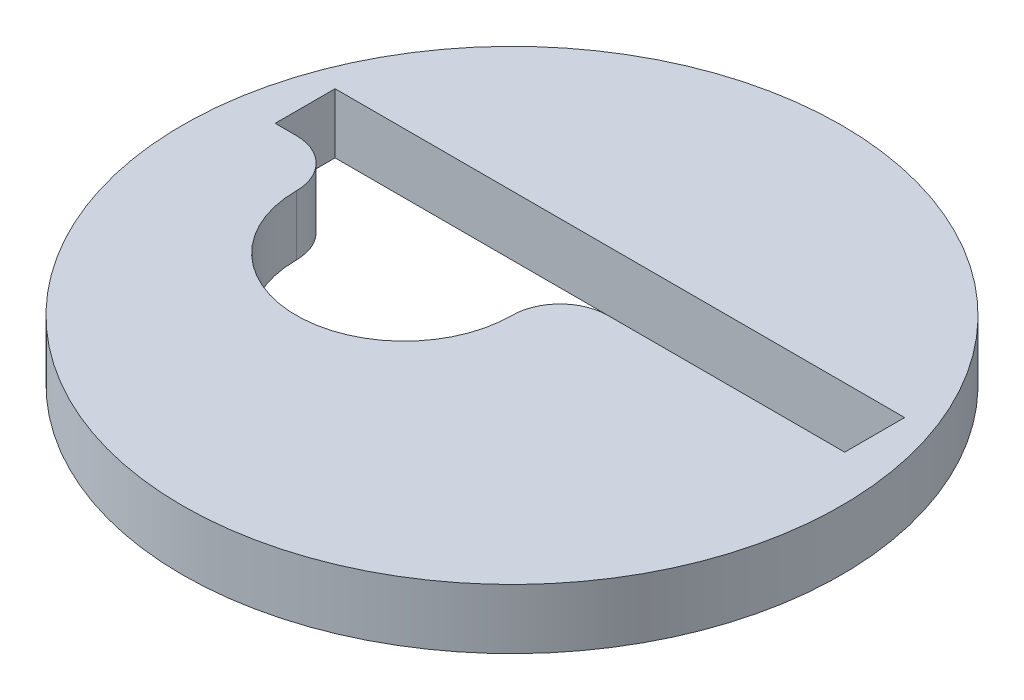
ISO-10303-21;
HEADER;
FILE_DESCRIPTION(('STEP AP214'),'2;1');
FILE_NAME('part.step','',(''),(''),'','','');
FILE_SCHEMA(('AUTOMOTIVE_DESIGN { 1 0 10303 214 1 1 1 1 }'));
ENDSEC;
DATA;
#1=APPLICATION_CONTEXT('core data for automotive mechanical design processes');
#2=APPLICATION_PROTOCOL_DEFINITION('international standard','automotive_design',2000,#1);
#3=PRODUCT_CONTEXT('',#1,'mechanical');
#4=PRODUCT('Part','Part','',(#3));
#5=PRODUCT_RELATED_PRODUCT_CATEGORY('part','',(#4));
#6=PRODUCT_DEFINITION_FORMATION('','',#4);
#7=PRODUCT_DEFINITION_CONTEXT('part definition',#1,'design');
#8=PRODUCT_DEFINITION('design','',#6,#7);
#9=PRODUCT_DEFINITION_SHAPE('','',#8);
#10=(LENGTH_UNIT() NAMED_UNIT(*) SI_UNIT(.MILLI.,.METRE.));
#11=(NAMED_UNIT(*) PLANE_ANGLE_UNIT() SI_UNIT($,.RADIAN.));
#12=(NAMED_UNIT(*) SI_UNIT($,.STERADIAN.) SOLID_ANGLE_UNIT());
#13=UNCERTAINTY_MEASURE_WITH_UNIT(LENGTH_MEASURE(1.E-05),#10,'distance_accuracy_value','');
#14=(GEOMETRIC_REPRESENTATION_CONTEXT(3) GLOBAL_UNCERTAINTY_ASSIGNED_CONTEXT((#13)) GLOBAL_UNIT_ASSIGNED_CONTEXT((#10,
#11,#12)) REPRESENTATION_CONTEXT('',''));
#15=CARTESIAN_POINT('',(0.,0.,0.));
#16=DIRECTION('',(0.,0.,1.));
#17=DIRECTION('',(1.,0.,0.));
#18=AXIS2_PLACEMENT_3D('',#15,#16,#17);
#19=CARTESIAN_POINT('',(-15.0899035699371,0.,-2.54));
#20=DIRECTION('',(0.,0.,1.));
#21=DIRECTION('',(1.,0.,0.));
#22=AXIS2_PLACEMENT_3D('',#19,#20,#21);
#23=PLANE('',#22);
#24=DIRECTION('',(1.,0.,0.));
#25=VECTOR('',#24,1.);
#26=CARTESIAN_POINT('',(-15.0899035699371,0.,-2.54));
#27=LINE('',#26,#25);
#28=CARTESIAN_POINT('',(2.54,0.,-2.54));
#29=VERTEX_POINT('',#28);
#30=CARTESIAN_POINT('',(15.0899035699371,0.,-2.54));
#31=VERTEX_POINT('',#30);
#32=EDGE_CURVE('E132',#29,#31,#27,.T.);
#33=ORIENTED_EDGE('',*,*,#32,.F.);
#34=DIRECTION('',(0.,1.,0.));
#35=VECTOR('',#34,1.);
#36=CARTESIAN_POINT('',(2.54,0.,-2.54));
#37=LINE('',#36,#35);
#38=CARTESIAN_POINT('',(2.54,3.175,-2.54));
#39=VERTEX_POINT('',#38);
#40=EDGE_CURVE('E162',#29,#39,#37,.T.);
#41=ORIENTED_EDGE('',*,*,#40,.T.);
#42=DIRECTION('',(1.,0.,0.));
#43=VECTOR('',#42,1.);
#44=CARTESIAN_POINT('',(-15.0899035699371,3.175,-2.54));
#45=LINE('',#44,#43);
#46=CARTESIAN_POINT('',(15.0899035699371,3.175,-2.54));
#47=VERTEX_POINT('',#46);
#48=EDGE_CURVE('E137',#39,#47,#45,.T.);
#49=ORIENTED_EDGE('',*,*,#48,.T.);
#50=DIRECTION('',(0.,1.,0.));
#51=VECTOR('',#50,1.);
#52=CARTESIAN_POINT('',(15.0899035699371,0.,-2.54));
#53=LINE('',#52,#51);
#54=EDGE_CURVE('E153',#31,#47,#53,.T.);
#55=ORIENTED_EDGE('',*,*,#54,.F.);
#56=EDGE_LOOP('',(#33,#41,#49,#55));
#57=FACE_BOUND('',#56,.T.);
#58=ADVANCED_FACE('F40',(#57),#23,.F.);
#59=CARTESIAN_POINT('',(0.,3.175,0.));
#60=DIRECTION('',(0.,-1.,0.));
#61=DIRECTION('',(0.,0.,-1.));
#62=AXIS2_PLACEMENT_3D('',#59,#60,#61);
#63=CYLINDRICAL_SURFACE('',#62,17.4625);
#64=CARTESIAN_POINT('',(0.,3.175,0.));
#65=DIRECTION('',(0.,1.,0.));
#66=DIRECTION('',(0.,0.,1.));
#67=AXIS2_PLACEMENT_3D('',#64,#65,#66);
#68=CIRCLE('',#67,17.4625);
#69=CARTESIAN_POINT('',(0.,3.175,17.4625));
#70=VERTEX_POINT('',#69);
#71=EDGE_CURVE('E159',#70,#70,#68,.T.);
#72=ORIENTED_EDGE('',*,*,#71,.F.);
#73=EDGE_LOOP('',(#72));
#74=FACE_BOUND('',#73,.T.);
#75=CARTESIAN_POINT('',(0.,0.,0.));
#76=DIRECTION('',(0.,1.,0.));
#77=DIRECTION('',(0.,0.,1.));
#78=AXIS2_PLACEMENT_3D('',#75,#76,#77);
#79=CIRCLE('',#78,17.4625);
#80=CARTESIAN_POINT('',(0.,0.,17.4625));
#81=VERTEX_POINT('',#80);
#82=EDGE_CURVE('E155',#81,#81,#79,.T.);
#83=ORIENTED_EDGE('',*,*,#82,.T.);
#84=EDGE_LOOP('',(#83));
#85=FACE_BOUND('',#84,.T.);
#86=ADVANCED_FACE('F202',(#74,#85),#63,.T.);
#87=CARTESIAN_POINT('',(0.,3.175,0.));
#88=DIRECTION('',(0.,1.,0.));
#89=DIRECTION('',(0.,0.,1.));
#90=AXIS2_PLACEMENT_3D('',#87,#88,#89);
#91=PLANE('',#90);
#92=ORIENTED_EDGE('',*,*,#48,.F.);
#93=CARTESIAN_POINT('',(2.54,3.175,0.));
#94=DIRECTION('',(0.,1.,0.));
#95=DIRECTION('',(0.,0.,1.));
#96=AXIS2_PLACEMENT_3D('',#93,#94,#95);
#97=CIRCLE('',#96,2.54);
#98=CARTESIAN_POINT('',(0.,3.175,0.));
#99=VERTEX_POINT('',#98);
#100=EDGE_CURVE('E169',#39,#99,#97,.T.);
#101=ORIENTED_EDGE('',*,*,#100,.T.);
#102=CARTESIAN_POINT('',(-5.715,3.175,0.));
#103=DIRECTION('',(0.,1.,0.));
#104=DIRECTION('',(0.,0.,1.));
#105=AXIS2_PLACEMENT_3D('',#102,#103,#104);
#106=CIRCLE('',#105,5.715);
#107=CARTESIAN_POINT('',(-11.43,3.175,0.));
#108=VERTEX_POINT('',#107);
#109=EDGE_CURVE('E140',#108,#99,#106,.T.);
#110=ORIENTED_EDGE('',*,*,#109,.F.);
#111=CARTESIAN_POINT('',(-13.97,3.175,0.));
#112=DIRECTION('',(0.,1.,0.));
#113=DIRECTION('',(0.,0.,1.));
#114=AXIS2_PLACEMENT_3D('',#111,#112,#113);
#115=CIRCLE('',#114,2.54);
#116=CARTESIAN_POINT('',(-13.97,3.175,-2.54));
#117=VERTEX_POINT('',#116);
#118=EDGE_CURVE('E167',#108,#117,#115,.T.);
#119=ORIENTED_EDGE('',*,*,#118,.T.);
#120=CARTESIAN_POINT('',(-15.0899035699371,3.175,-2.54));
#121=VERTEX_POINT('',#120);
#122=EDGE_CURVE('E134',#121,#117,#45,.T.);
#123=ORIENTED_EDGE('',*,*,#122,.F.);
#124=DIRECTION('',(0.,0.,1.));
#125=VECTOR('',#124,1.);
#126=CARTESIAN_POINT('',(-15.0899035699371,3.175,-2.54));
#127=LINE('',#126,#125);
#128=CARTESIAN_POINT('',(-15.0899035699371,3.175,-5.715));
#129=VERTEX_POINT('',#128);
#130=EDGE_CURVE('E150',#129,#121,#127,.T.);
#131=ORIENTED_EDGE('',*,*,#130,.F.);
#132=DIRECTION('',(-1.,0.,0.));
#133=VECTOR('',#132,1.);
#134=CARTESIAN_POINT('',(-15.0899035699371,3.175,-5.715));
#135=LINE('',#134,#133);
#136=CARTESIAN_POINT('',(15.0899035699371,3.175,-5.715));
#137=VERTEX_POINT('',#136);
#138=EDGE_CURVE('E147',#137,#129,#135,.T.);
#139=ORIENTED_EDGE('',*,*,#138,.F.);
#140=DIRECTION('',(0.,0.,-1.));
#141=VECTOR('',#140,1.);
#142=CARTESIAN_POINT('',(15.0899035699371,3.175,-2.54));
#143=LINE('',#142,#141);
#144=EDGE_CURVE('E114',#47,#137,#143,.T.);
#145=ORIENTED_EDGE('',*,*,#144,.F.);
#146=EDGE_LOOP('',(#92,#101,#110,#119,#123,#131,#139,#145));
#147=FACE_BOUND('',#146,.T.);
#148=ORIENTED_EDGE('',*,*,#71,.T.);
#149=EDGE_LOOP('',(#148));
#150=FACE_BOUND('',#149,.T.);
#151=ADVANCED_FACE('F182',(#147,#150),#91,.T.);
#152=CARTESIAN_POINT('',(0.,0.,0.));
#153=DIRECTION('',(0.,1.,0.));
#154=DIRECTION('',(0.,0.,1.));
#155=AXIS2_PLACEMENT_3D('',#152,#153,#154);
#156=PLANE('',#155);
#157=CARTESIAN_POINT('',(-5.715,0.,0.));
#158=DIRECTION('',(0.,1.,0.));
#159=DIRECTION('',(0.,0.,1.));
#160=AXIS2_PLACEMENT_3D('',#157,#158,#159);
#161=CIRCLE('',#160,5.715);
#162=CARTESIAN_POINT('',(-11.43,0.,0.));
#163=VERTEX_POINT('',#162);
#164=CARTESIAN_POINT('',(0.,0.,0.));
#165=VERTEX_POINT('',#164);
#166=EDGE_CURVE('E148',#163,#165,#161,.T.);
#167=ORIENTED_EDGE('',*,*,#166,.T.);
#168=CARTESIAN_POINT('',(2.54,0.,0.));
#169=DIRECTION('',(0.,1.,0.));
#170=DIRECTION('',(0.,0.,1.));
#171=AXIS2_PLACEMENT_3D('',#168,#169,#170);
#172=CIRCLE('',#171,2.54);
#173=EDGE_CURVE('E48',#165,#29,#172,.F.);
#174=ORIENTED_EDGE('',*,*,#173,.T.);
#175=ORIENTED_EDGE('',*,*,#32,.T.);
#176=DIRECTION('',(0.,0.,-1.));
#177=VECTOR('',#176,1.);
#178=CARTESIAN_POINT('',(15.0899035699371,0.,-2.54));
#179=LINE('',#178,#177);
#180=CARTESIAN_POINT('',(15.0899035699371,0.,-5.715));
#181=VERTEX_POINT('',#180);
#182=EDGE_CURVE('E112',#31,#181,#179,.T.);
#183=ORIENTED_EDGE('',*,*,#182,.T.);
#184=DIRECTION('',(-1.,0.,0.));
#185=VECTOR('',#184,1.);
#186=CARTESIAN_POINT('',(-15.0899035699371,0.,-5.715));
#187=LINE('',#186,#185);
#188=CARTESIAN_POINT('',(-15.0899035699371,0.,-5.715));
#189=VERTEX_POINT('',#188);
#190=EDGE_CURVE('E121',#181,#189,#187,.T.);
#191=ORIENTED_EDGE('',*,*,#190,.T.);
#192=DIRECTION('',(0.,0.,1.));
#193=VECTOR('',#192,1.);
#194=CARTESIAN_POINT('',(-15.0899035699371,0.,-2.54));
#195=LINE('',#194,#193);
#196=CARTESIAN_POINT('',(-15.0899035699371,0.,-2.54));
#197=VERTEX_POINT('',#196);
#198=EDGE_CURVE('E127',#189,#197,#195,.T.);
#199=ORIENTED_EDGE('',*,*,#198,.T.);
#200=CARTESIAN_POINT('',(-13.97,0.,-2.54));
#201=VERTEX_POINT('',#200);
#202=EDGE_CURVE('E118',#197,#201,#27,.T.);
#203=ORIENTED_EDGE('',*,*,#202,.T.);
#204=CARTESIAN_POINT('',(-13.97,0.,0.));
#205=DIRECTION('',(0.,1.,0.));
#206=DIRECTION('',(0.,0.,1.));
#207=AXIS2_PLACEMENT_3D('',#204,#205,#206);
#208=CIRCLE('',#207,2.54);
#209=EDGE_CURVE('E55',#201,#163,#208,.F.);
#210=ORIENTED_EDGE('',*,*,#209,.T.);
#211=EDGE_LOOP('',(#167,#174,#175,#183,#191,#199,#203,#210));
#212=FACE_BOUND('',#211,.T.);
#213=ORIENTED_EDGE('',*,*,#82,.F.);
#214=EDGE_LOOP('',(#213));
#215=FACE_BOUND('',#214,.T.);
#216=ADVANCED_FACE('F129',(#212,#215),#156,.F.);
#217=CARTESIAN_POINT('',(15.0899035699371,0.,-2.54));
#218=DIRECTION('',(1.,0.,0.));
#219=DIRECTION('',(0.,0.,-1.));
#220=AXIS2_PLACEMENT_3D('',#217,#218,#219);
#221=PLANE('',#220);
#222=ORIENTED_EDGE('',*,*,#144,.T.);
#223=DIRECTION('',(0.,1.,0.));
#224=VECTOR('',#223,1.);
#225=CARTESIAN_POINT('',(15.0899035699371,0.,-5.715));
#226=LINE('',#225,#224);
#227=EDGE_CURVE('E107',#181,#137,#226,.T.);
#228=ORIENTED_EDGE('',*,*,#227,.F.);
#229=ORIENTED_EDGE('',*,*,#182,.F.);
#230=ORIENTED_EDGE('',*,*,#54,.T.);
#231=EDGE_LOOP('',(#222,#228,#229,#230));
#232=FACE_BOUND('',#231,.T.);
#233=ADVANCED_FACE('F109',(#232),#221,.F.);
#234=ORIENTED_EDGE('',*,*,#122,.T.);
#235=DIRECTION('',(0.,1.,0.));
#236=VECTOR('',#235,1.);
#237=CARTESIAN_POINT('',(-13.97,0.,-2.54));
#238=LINE('',#237,#236);
#239=EDGE_CURVE('E11',#117,#201,#238,.F.);
#240=ORIENTED_EDGE('',*,*,#239,.T.);
#241=ORIENTED_EDGE('',*,*,#202,.F.);
#242=DIRECTION('',(0.,1.,0.));
#243=VECTOR('',#242,1.);
#244=CARTESIAN_POINT('',(-15.0899035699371,0.,-2.54));
#245=LINE('',#244,#243);
#246=EDGE_CURVE('E156',#197,#121,#245,.T.);
#247=ORIENTED_EDGE('',*,*,#246,.T.);
#248=EDGE_LOOP('',(#234,#240,#241,#247));
#249=FACE_BOUND('',#248,.T.);
#250=ADVANCED_FACE('F189',(#249),#23,.F.);
#251=CARTESIAN_POINT('',(-15.0899035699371,0.,-2.54));
#252=DIRECTION('',(-1.,0.,0.));
#253=DIRECTION('',(0.,0.,1.));
#254=AXIS2_PLACEMENT_3D('',#251,#252,#253);
#255=PLANE('',#254);
#256=ORIENTED_EDGE('',*,*,#130,.T.);
#257=ORIENTED_EDGE('',*,*,#246,.F.);
#258=ORIENTED_EDGE('',*,*,#198,.F.);
#259=DIRECTION('',(0.,1.,0.));
#260=VECTOR('',#259,1.);
#261=CARTESIAN_POINT('',(-15.0899035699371,0.,-5.715));
#262=LINE('',#261,#260);
#263=EDGE_CURVE('E117',#189,#129,#262,.T.);
#264=ORIENTED_EDGE('',*,*,#263,.T.);
#265=EDGE_LOOP('',(#256,#257,#258,#264));
#266=FACE_BOUND('',#265,.T.);
#267=ADVANCED_FACE('F192',(#266),#255,.F.);
#268=CARTESIAN_POINT('',(-15.0899035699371,0.,-5.715));
#269=DIRECTION('',(0.,0.,-1.));
#270=DIRECTION('',(-1.,0.,0.));
#271=AXIS2_PLACEMENT_3D('',#268,#269,#270);
#272=PLANE('',#271);
#273=ORIENTED_EDGE('',*,*,#263,.F.);
#274=ORIENTED_EDGE('',*,*,#190,.F.);
#275=ORIENTED_EDGE('',*,*,#227,.T.);
#276=ORIENTED_EDGE('',*,*,#138,.T.);
#277=EDGE_LOOP('',(#273,#274,#275,#276));
#278=FACE_BOUND('',#277,.T.);
#279=ADVANCED_FACE('F122',(#278),#272,.F.);
#280=CARTESIAN_POINT('',(-5.715,0.,0.));
#281=DIRECTION('',(0.,1.,0.));
#282=DIRECTION('',(0.,0.,1.));
#283=AXIS2_PLACEMENT_3D('',#280,#281,#282);
#284=CYLINDRICAL_SURFACE('',#283,5.715);
#285=ORIENTED_EDGE('',*,*,#109,.T.);
#286=DIRECTION('',(0.,1.,0.));
#287=VECTOR('',#286,1.);
#288=CARTESIAN_POINT('',(0.,0.,0.));
#289=LINE('',#288,#287);
#290=EDGE_CURVE('E62',#99,#165,#289,.F.);
#291=ORIENTED_EDGE('',*,*,#290,.T.);
#292=ORIENTED_EDGE('',*,*,#166,.F.);
#293=DIRECTION('',(0.,1.,0.));
#294=VECTOR('',#293,1.);
#295=CARTESIAN_POINT('',(-11.43,0.,0.));
#296=LINE('',#295,#294);
#297=EDGE_CURVE('E171',#163,#108,#296,.T.);
#298=ORIENTED_EDGE('',*,*,#297,.T.);
#299=EDGE_LOOP('',(#285,#291,#292,#298));
#300=FACE_BOUND('',#299,.T.);
#301=ADVANCED_FACE('F185',(#300),#284,.F.);
#302=CARTESIAN_POINT('',(2.54,0.,0.));
#303=DIRECTION('',(0.,1.,0.));
#304=DIRECTION('',(0.,0.,1.));
#305=AXIS2_PLACEMENT_3D('',#302,#303,#304);
#306=CYLINDRICAL_SURFACE('',#305,2.54);
#307=ORIENTED_EDGE('',*,*,#173,.F.);
#308=ORIENTED_EDGE('',*,*,#290,.F.);
#309=ORIENTED_EDGE('',*,*,#100,.F.);
#310=ORIENTED_EDGE('',*,*,#40,.F.);
#311=EDGE_LOOP('',(#307,#308,#309,#310));
#312=FACE_BOUND('',#311,.T.);
#313=ADVANCED_FACE('F179',(#312),#306,.T.);
#314=CARTESIAN_POINT('',(-13.97,0.,0.));
#315=DIRECTION('',(0.,1.,0.));
#316=DIRECTION('',(0.,0.,1.));
#317=AXIS2_PLACEMENT_3D('',#314,#315,#316);
#318=CYLINDRICAL_SURFACE('',#317,2.54);
#319=ORIENTED_EDGE('',*,*,#118,.F.);
#320=ORIENTED_EDGE('',*,*,#297,.F.);
#321=ORIENTED_EDGE('',*,*,#209,.F.);
#322=ORIENTED_EDGE('',*,*,#239,.F.);
#323=EDGE_LOOP('',(#319,#320,#321,#322));
#324=FACE_BOUND('',#323,.T.);
#325=ADVANCED_FACE('F42',(#324),#318,.T.);
#326=CLOSED_SHELL('',(#58,#86,#151,#216,#233,#250,#267,#279,#301,#313,#325));
#327=MANIFOLD_SOLID_BREP('B2',#326);
#328=ADVANCED_BREP_SHAPE_REPRESENTATION('',(#18,#327),#14);
#329=SHAPE_DEFINITION_REPRESENTATION(#9,#328);
ENDSEC;
END-ISO-10303-21;
